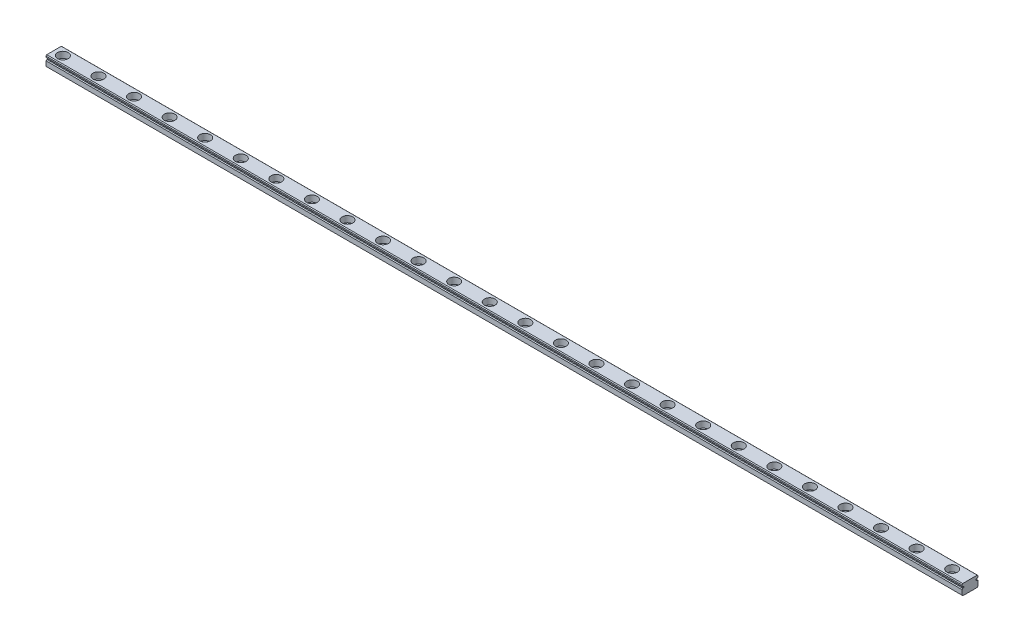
from build123d import *

# Parameters (mm, degrees)
BOSS_EXTRUDE1_DEPTH                              = 515
CUT_EXTRUDE1_DEPTH                               = 516.054608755
CUT_EXTRUDE2_DEPTH                               = 516.054608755
CUT_EXTRUDE3_DEPTH                               = 60
CUT_EXTRUDE4_DEPTH                               = 516.054608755
CUT_EXTRUDE5_DEPTH                               = 516.054608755
CBORE_FOR_M3_HEX_HEAD_MACHINE_SCREW1_D           = 3.5
CBORE_FOR_M3_HEX_HEAD_MACHINE_SCREW1_CBORE_D     = 6
CBORE_FOR_M3_HEX_HEAD_MACHINE_SCREW1_CBORE_DEPTH = 3.5
CHAMFER1_SIZE                                    = 0.2
CHAMFER2_SIZE                                    = 0.5
LPATTERN1_COUNT                                  = 9
LPATTERN1_PITCH                                  = 60


with BuildPart() as part:
    # Sketch1 → Boss-Extrude1 (new body)
    with BuildSketch(Plane(origin=(50, 0, 0), x_dir=(0, 0, -1), z_dir=(1, 0, 0))):
        with BuildLine():
            Line((-4.5, 5.5), (-4.5, 0))
            Line((-4.5, 0), (4.5, 0))
            Line((4.5, 0), (4.5, 5.5))
            ThreePointArc((4.5, 5.5), (4.341101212, 5.78288097), (4.1, 6))
            Line((4.1, 6), (-4.1, 6))
            ThreePointArc((-4.1, 6), (-4.341101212, 5.78288097), (-4.5, 5.5))
        make_face()
    extrude(amount=-BOSS_EXTRUDE1_DEPTH)

    # Sketch2 → Cut-Extrude1 (cut, through all)
    with BuildSketch(Plane.ZY.offset(465)):
        with BuildLine():
            Line((4.5, 3.224371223), (4.5, 4.775628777))
            ThreePointArc((4.5, 4.775628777), (3.86, 4), (4.5, 3.224371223))
        make_face()
    extrude(amount=-CUT_EXTRUDE1_DEPTH, mode=Mode.SUBTRACT)

    # Sketch3 → Cut-Extrude2 (cut, through all)
    with BuildSketch(Plane.ZY.offset(465)):
        with BuildLine():
            Line((3.968751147, 4.4), (3.52, 4.32))
            ThreePointArc((3.52, 4.32), (3.451288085, 4.254355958), (3.4, 4.174355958))
            Line((3.4, 4.174355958), (3.4, 3.825644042))
            ThreePointArc((3.4, 3.825644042), (3.451288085, 3.745644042), (3.52, 3.68))
            Line((3.52, 3.68), (3.968751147, 3.6))
            ThreePointArc((3.968751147, 3.6), (3.86, 4), (3.968751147, 4.4))
        make_face()
    extrude(amount=-CUT_EXTRUDE2_DEPTH, mode=Mode.SUBTRACT)

    # Sketch4 → Cut-Extrude3 (cut)
    with BuildSketch(Plane.ZY.offset(465)):
        with BuildLine():
            Line((-2.9, 0), (-2.1, 0))
            ThreePointArc((-2.1, 0), (-2.5, 0.2), (-2.9, 0))
        make_face()
    extrude(amount=-CUT_EXTRUDE3_DEPTH, mode=Mode.SUBTRACT)

    # Sketch5 → Cut-Extrude4 (cut, through all)
    with BuildSketch(Plane.ZY.offset(465)):
        with BuildLine():
            Line((-4.5, 4.775628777), (-4.5, 3.224371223))
            ThreePointArc((-4.5, 3.224371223), (-3.86, 4), (-4.5, 4.775628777))
        make_face()
    extrude(amount=-CUT_EXTRUDE4_DEPTH, mode=Mode.SUBTRACT)

    # Sketch6 → Cut-Extrude5 (cut, through all)
    with BuildSketch(Plane.ZY.offset(465)):
        with BuildLine():
            Line((-3.968751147, 3.6), (-3.52, 3.68))
            ThreePointArc((-3.52, 3.68), (-3.451288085, 3.745644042), (-3.4, 3.825644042))
            Line((-3.4, 3.825644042), (-3.4, 4.174355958))
            ThreePointArc((-3.4, 4.174355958), (-3.451288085, 4.254355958), (-3.52, 4.32))
            Line((-3.52, 4.32), (-3.968751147, 4.4))
            ThreePointArc((-3.968751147, 4.4), (-3.86, 4), (-3.968751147, 3.6))
        make_face()
    extrude(amount=-CUT_EXTRUDE5_DEPTH, mode=Mode.SUBTRACT)

    # CBORE for M3 Hex Head Machine Screw1 (through all)
    with Locations(Plane(origin=(0, 6, 0), x_dir=(1, 0, 0), z_dir=(0, 1, 0))):
        with Locations((20, 0), (40, 0), (0, 0)):
            cbore_for_m3_hex_head_machine_screw1 = CounterBoreHole(CBORE_FOR_M3_HEX_HEAD_MACHINE_SCREW1_D / 2, CBORE_FOR_M3_HEX_HEAD_MACHINE_SCREW1_CBORE_D / 2, CBORE_FOR_M3_HEX_HEAD_MACHINE_SCREW1_CBORE_DEPTH)

    # Chamfer1
    chamfer1_edges = [part.edges().sort_by_distance(p)[0] for p in [
        (41.75, 0, 0),
        (21.75, 0, 0),
        (1.75, 0, 0),
    ]]
    chamfer(chamfer1_edges, length=CHAMFER1_SIZE)

    # Chamfer2
    chamfer2_edges = [part.edges().sort_by_distance(p)[0] for p in [
        (-207.5, 0, -4.5),
        (-207.5, 0, 4.5),
    ]]
    chamfer(chamfer2_edges, length=CHAMFER2_SIZE)

    # LPattern1: CBORE for M3 Hex Head Machine Screw1 ×9
    with Locations(*[(-i * LPATTERN1_PITCH, 0, 0) for i in range(1, LPATTERN1_COUNT)]):
        add(cbore_for_m3_hex_head_machine_screw1, mode=Mode.SUBTRACT)


solid = part.part
